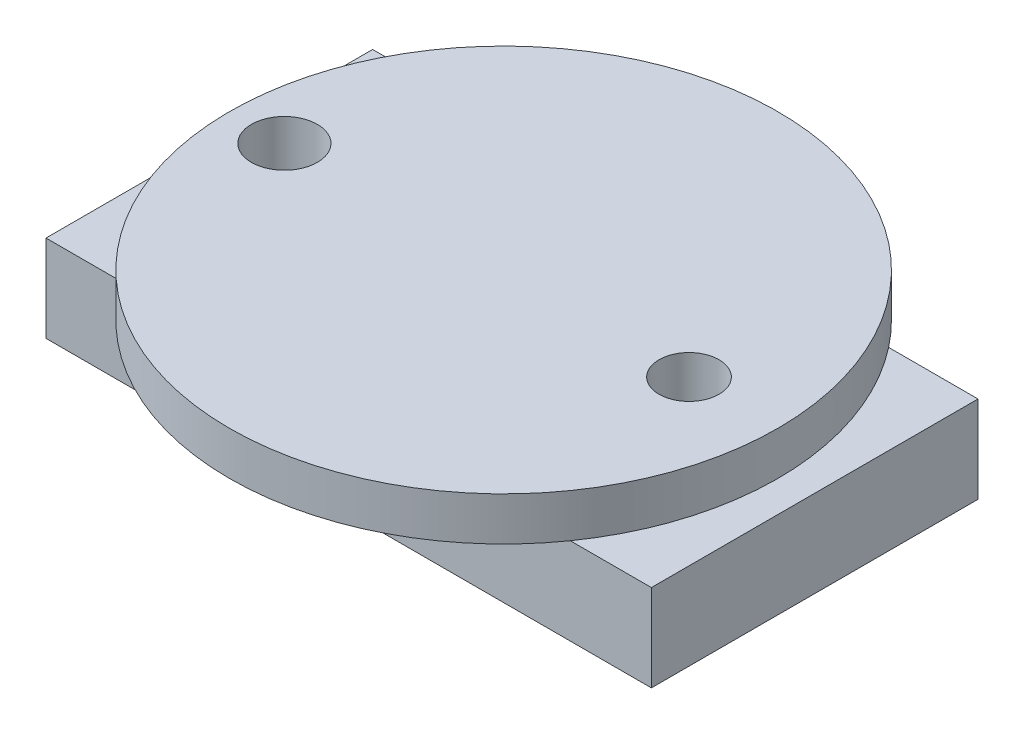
ISO-10303-21;
HEADER;
FILE_DESCRIPTION(('STEP AP214'),'2;1');
FILE_NAME('part.step','',(''),(''),'','','');
FILE_SCHEMA(('AUTOMOTIVE_DESIGN { 1 0 10303 214 1 1 1 1 }'));
ENDSEC;
DATA;
#1=APPLICATION_CONTEXT('core data for automotive mechanical design processes');
#2=APPLICATION_PROTOCOL_DEFINITION('international standard','automotive_design',2000,#1);
#3=PRODUCT_CONTEXT('',#1,'mechanical');
#4=PRODUCT('Part','Part','',(#3));
#5=PRODUCT_RELATED_PRODUCT_CATEGORY('part','',(#4));
#6=PRODUCT_DEFINITION_FORMATION('','',#4);
#7=PRODUCT_DEFINITION_CONTEXT('part definition',#1,'design');
#8=PRODUCT_DEFINITION('design','',#6,#7);
#9=PRODUCT_DEFINITION_SHAPE('','',#8);
#10=(LENGTH_UNIT() NAMED_UNIT(*) SI_UNIT(.MILLI.,.METRE.));
#11=(NAMED_UNIT(*) PLANE_ANGLE_UNIT() SI_UNIT($,.RADIAN.));
#12=(NAMED_UNIT(*) SI_UNIT($,.STERADIAN.) SOLID_ANGLE_UNIT());
#13=UNCERTAINTY_MEASURE_WITH_UNIT(LENGTH_MEASURE(1.E-05),#10,'distance_accuracy_value','');
#14=(GEOMETRIC_REPRESENTATION_CONTEXT(3) GLOBAL_UNCERTAINTY_ASSIGNED_CONTEXT((#13)) GLOBAL_UNIT_ASSIGNED_CONTEXT((#10,
#11,#12)) REPRESENTATION_CONTEXT('',''));
#15=CARTESIAN_POINT('',(0.,0.,0.));
#16=DIRECTION('',(0.,0.,1.));
#17=DIRECTION('',(1.,0.,0.));
#18=AXIS2_PLACEMENT_3D('',#15,#16,#17);
#19=CARTESIAN_POINT('',(-60.2555483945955,12.7,0.));
#20=DIRECTION('',(0.,1.,0.));
#21=DIRECTION('',(0.,0.,1.));
#22=AXIS2_PLACEMENT_3D('',#19,#20,#21);
#23=PLANE('',#22);
#24=CARTESIAN_POINT('',(-60.2555483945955,12.7,0.));
#25=DIRECTION('',(0.,1.,0.));
#26=DIRECTION('',(0.,0.,1.));
#27=AXIS2_PLACEMENT_3D('',#24,#25,#26);
#28=CIRCLE('',#27,80.1370931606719);
#29=CARTESIAN_POINT('',(2.87709007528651,12.7,-49.3581164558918));
#30=VERTEX_POINT('',#29);
#31=CARTESIAN_POINT('',(-123.388186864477,12.7,-49.3581164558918));
#32=VERTEX_POINT('',#31);
#33=EDGE_CURVE('E496',#30,#32,#28,.T.);
#34=ORIENTED_EDGE('',*,*,#33,.F.);
#35=DIRECTION('',(1.,0.,0.));
#36=VECTOR('',#35,1.);
#37=CARTESIAN_POINT('',(0.,12.7,-49.3581164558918));
#38=LINE('',#37,#36);
#39=EDGE_CURVE('E356',#32,#30,#38,.T.);
#40=ORIENTED_EDGE('',*,*,#39,.F.);
#41=EDGE_LOOP('',(#34,#40));
#42=FACE_BOUND('',#41,.T.);
#43=ADVANCED_FACE('F88',(#42),#23,.F.);
#44=DIRECTION('',(1.,0.,0.));
#45=VECTOR('',#44,1.);
#46=CARTESIAN_POINT('',(0.,12.7,46.0863602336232));
#47=LINE('',#46,#45);
#48=CARTESIAN_POINT('',(-125.814690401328,12.7,46.0863602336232));
#49=VERTEX_POINT('',#48);
#50=CARTESIAN_POINT('',(5.303593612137,12.7,46.0863602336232));
#51=VERTEX_POINT('',#50);
#52=EDGE_CURVE('E364',#49,#51,#47,.T.);
#53=ORIENTED_EDGE('',*,*,#52,.T.);
#54=EDGE_CURVE('E484',#49,#51,#28,.T.);
#55=ORIENTED_EDGE('',*,*,#54,.F.);
#56=EDGE_LOOP('',(#53,#55));
#57=FACE_BOUND('',#56,.T.);
#58=ADVANCED_FACE('F607',(#57),#23,.F.);
#59=CARTESIAN_POINT('',(-45.9128356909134,12.7,0.));
#60=DIRECTION('',(0.,-1.,0.));
#61=DIRECTION('',(0.,0.,-1.));
#62=AXIS2_PLACEMENT_3D('',#59,#60,#61);
#63=CYLINDRICAL_SURFACE('',#62,16.9408801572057);
#64=CARTESIAN_POINT('',(-45.9128356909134,0.,0.));
#65=DIRECTION('',(0.,1.,0.));
#66=DIRECTION('',(0.,0.,1.));
#67=AXIS2_PLACEMENT_3D('',#64,#65,#66);
#68=CIRCLE('',#67,16.9408801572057);
#69=CARTESIAN_POINT('',(-62.0762271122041,0.,-5.07328278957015));
#70=VERTEX_POINT('',#69);
#71=CARTESIAN_POINT('',(-62.0716324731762,0.,5.08789809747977));
#72=VERTEX_POINT('',#71);
#73=EDGE_CURVE('E491',#70,#72,#68,.T.);
#74=ORIENTED_EDGE('',*,*,#73,.F.);
#75=DIRECTION('',(0.,-1.,0.));
#76=VECTOR('',#75,1.);
#77=CARTESIAN_POINT('',(-62.0762271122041,12.7,-5.07328278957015));
#78=LINE('',#77,#76);
#79=CARTESIAN_POINT('',(-62.0762271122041,12.7,-5.07328278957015));
#80=VERTEX_POINT('',#79);
#81=EDGE_CURVE('E12',#80,#70,#78,.T.);
#82=ORIENTED_EDGE('',*,*,#81,.F.);
#83=CARTESIAN_POINT('',(-45.9128356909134,12.7,0.));
#84=DIRECTION('',(0.,1.,0.));
#85=DIRECTION('',(0.,0.,1.));
#86=AXIS2_PLACEMENT_3D('',#83,#84,#85);
#87=CIRCLE('',#86,16.9408801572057);
#88=CARTESIAN_POINT('',(-62.0716324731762,12.7,5.08789809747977));
#89=VERTEX_POINT('',#88);
#90=EDGE_CURVE('E497',#80,#89,#87,.T.);
#91=ORIENTED_EDGE('',*,*,#90,.T.);
#92=DIRECTION('',(0.,-1.,0.));
#93=VECTOR('',#92,1.);
#94=CARTESIAN_POINT('',(-62.0716324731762,12.7,5.08789809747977));
#95=LINE('',#94,#93);
#96=EDGE_CURVE('E525',#89,#72,#95,.T.);
#97=ORIENTED_EDGE('',*,*,#96,.T.);
#98=EDGE_LOOP('',(#74,#82,#91,#97));
#99=FACE_BOUND('',#98,.T.);
#100=ADVANCED_FACE('F90',(#99),#63,.F.);
#101=CARTESIAN_POINT('',(-44.4304299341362,12.7,25.5782106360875));
#102=DIRECTION('',(-0.866647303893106,0.,0.498921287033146));
#103=DIRECTION('',(0.498921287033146,0.,0.866647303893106));
#104=AXIS2_PLACEMENT_3D('',#101,#102,#103);
#105=PLANE('',#104);
#106=DIRECTION('',(-0.498921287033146,0.,-0.866647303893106));
#107=VECTOR('',#106,1.);
#108=CARTESIAN_POINT('',(-44.4304299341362,0.,25.5782106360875));
#109=LINE('',#108,#107);
#110=CARTESIAN_POINT('',(-69.517094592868,0.,-17.9983832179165));
#111=VERTEX_POINT('',#110);
#112=EDGE_CURVE('E528',#70,#111,#109,.T.);
#113=ORIENTED_EDGE('',*,*,#112,.T.);
#114=DIRECTION('',(0.,-1.,0.));
#115=VECTOR('',#114,1.);
#116=CARTESIAN_POINT('',(-69.517094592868,12.7,-17.9983832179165));
#117=LINE('',#116,#115);
#118=CARTESIAN_POINT('',(-69.517094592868,12.7,-17.9983832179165));
#119=VERTEX_POINT('',#118);
#120=EDGE_CURVE('E97',#119,#111,#117,.T.);
#121=ORIENTED_EDGE('',*,*,#120,.F.);
#122=DIRECTION('',(-0.498921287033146,0.,-0.866647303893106));
#123=VECTOR('',#122,1.);
#124=CARTESIAN_POINT('',(-44.4304299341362,12.7,25.5782106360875));
#125=LINE('',#124,#123);
#126=EDGE_CURVE('E500',#80,#119,#125,.T.);
#127=ORIENTED_EDGE('',*,*,#126,.F.);
#128=ORIENTED_EDGE('',*,*,#81,.T.);
#129=EDGE_LOOP('',(#113,#121,#127,#128));
#130=FACE_BOUND('',#129,.T.);
#131=ADVANCED_FACE('F576',(#130),#105,.F.);
#132=CARTESIAN_POINT('',(0.0223027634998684,12.7,-17.9117966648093));
#133=DIRECTION('',(-0.0012451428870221,0.,0.999999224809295));
#134=DIRECTION('',(0.999999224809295,0.,0.0012451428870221));
#135=AXIS2_PLACEMENT_3D('',#132,#133,#134);
#136=PLANE('',#135);
#137=DIRECTION('',(-0.999999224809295,0.,-0.0012451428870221));
#138=VECTOR('',#137,1.);
#139=CARTESIAN_POINT('',(0.0223027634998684,0.,-17.9117966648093));
#140=LINE('',#139,#138);
#141=CARTESIAN_POINT('',(-90.3147885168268,0.,-18.0242793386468));
#142=VERTEX_POINT('',#141);
#143=EDGE_CURVE('E532',#111,#142,#140,.T.);
#144=ORIENTED_EDGE('',*,*,#143,.T.);
#145=DIRECTION('',(0.,-1.,0.));
#146=VECTOR('',#145,1.);
#147=CARTESIAN_POINT('',(-90.3147885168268,12.7,-18.0242793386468));
#148=LINE('',#147,#146);
#149=CARTESIAN_POINT('',(-90.3147885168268,12.7,-18.0242793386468));
#150=VERTEX_POINT('',#149);
#151=EDGE_CURVE('E566',#150,#142,#148,.T.);
#152=ORIENTED_EDGE('',*,*,#151,.F.);
#153=DIRECTION('',(-0.999999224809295,0.,-0.0012451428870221));
#154=VECTOR('',#153,1.);
#155=CARTESIAN_POINT('',(0.0223027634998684,12.7,-17.9117966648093));
#156=LINE('',#155,#154);
#157=EDGE_CURVE('E505',#119,#150,#156,.T.);
#158=ORIENTED_EDGE('',*,*,#157,.F.);
#159=ORIENTED_EDGE('',*,*,#120,.T.);
#160=EDGE_LOOP('',(#144,#152,#158,#159));
#161=FACE_BOUND('',#160,.T.);
#162=ADVANCED_FACE('F573',(#161),#136,.F.);
#163=CARTESIAN_POINT('',(-75.4545718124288,12.7,-43.6890765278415));
#164=DIRECTION('',(0.865402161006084,0.,0.50107793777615));
#165=DIRECTION('',(0.50107793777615,0.,-0.865402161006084));
#166=AXIS2_PLACEMENT_3D('',#163,#164,#165);
#167=PLANE('',#166);
#168=DIRECTION('',(-0.50107793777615,0.,0.865402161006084));
#169=VECTOR('',#168,1.);
#170=CARTESIAN_POINT('',(-75.4545718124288,0.,-43.6890765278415));
#171=LINE('',#170,#169);
#172=CARTESIAN_POINT('',(-100.736062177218,0.,-0.0258961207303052));
#173=VERTEX_POINT('',#172);
#174=EDGE_CURVE('E536',#142,#173,#171,.T.);
#175=ORIENTED_EDGE('',*,*,#174,.T.);
#176=DIRECTION('',(0.,-1.,0.));
#177=VECTOR('',#176,1.);
#178=CARTESIAN_POINT('',(-100.736062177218,12.7,-0.0258961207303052));
#179=LINE('',#178,#177);
#180=CARTESIAN_POINT('',(-100.736062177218,12.7,-0.0258961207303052));
#181=VERTEX_POINT('',#180);
#182=EDGE_CURVE('E562',#181,#173,#179,.T.);
#183=ORIENTED_EDGE('',*,*,#182,.F.);
#184=DIRECTION('',(-0.50107793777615,0.,0.865402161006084));
#185=VECTOR('',#184,1.);
#186=CARTESIAN_POINT('',(-75.4545718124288,12.7,-43.6890765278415));
#187=LINE('',#186,#185);
#188=EDGE_CURVE('E509',#150,#181,#187,.T.);
#189=ORIENTED_EDGE('',*,*,#188,.F.);
#190=ORIENTED_EDGE('',*,*,#151,.T.);
#191=EDGE_LOOP('',(#175,#183,#189,#190));
#192=FACE_BOUND('',#191,.T.);
#193=ADVANCED_FACE('F582',(#192),#167,.F.);
#194=CARTESIAN_POINT('',(-75.6493975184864,12.7,43.5506977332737));
#195=DIRECTION('',(0.866647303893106,0.,-0.498921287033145));
#196=DIRECTION('',(-0.498921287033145,0.,-0.866647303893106));
#197=AXIS2_PLACEMENT_3D('',#194,#195,#196);
#198=PLANE('',#197);
#199=DIRECTION('',(0.498921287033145,0.,0.866647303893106));
#200=VECTOR('',#199,1.);
#201=CARTESIAN_POINT('',(-75.6493975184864,0.,43.5506977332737));
#202=LINE('',#201,#200);
#203=CARTESIAN_POINT('',(-90.3596419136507,0.,17.9983832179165));
#204=VERTEX_POINT('',#203);
#205=EDGE_CURVE('E540',#173,#204,#202,.T.);
#206=ORIENTED_EDGE('',*,*,#205,.T.);
#207=DIRECTION('',(0.,-1.,0.));
#208=VECTOR('',#207,1.);
#209=CARTESIAN_POINT('',(-90.3596419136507,12.7,17.9983832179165));
#210=LINE('',#209,#208);
#211=CARTESIAN_POINT('',(-90.3596419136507,12.7,17.9983832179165));
#212=VERTEX_POINT('',#211);
#213=EDGE_CURVE('E558',#212,#204,#210,.T.);
#214=ORIENTED_EDGE('',*,*,#213,.F.);
#215=DIRECTION('',(0.498921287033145,0.,0.866647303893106));
#216=VECTOR('',#215,1.);
#217=CARTESIAN_POINT('',(-75.6493975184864,12.7,43.5506977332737));
#218=LINE('',#217,#216);
#219=EDGE_CURVE('E513',#181,#212,#218,.T.);
#220=ORIENTED_EDGE('',*,*,#219,.F.);
#221=ORIENTED_EDGE('',*,*,#182,.T.);
#222=EDGE_LOOP('',(#206,#214,#220,#221));
#223=FACE_BOUND('',#222,.T.);
#224=ADVANCED_FACE('F586',(#223),#198,.F.);
#225=CARTESIAN_POINT('',(-0.0225506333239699,12.7,18.110865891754));
#226=DIRECTION('',(0.0012451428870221,0.,-0.999999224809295));
#227=DIRECTION('',(-0.999999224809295,0.,-0.0012451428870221));
#228=AXIS2_PLACEMENT_3D('',#225,#226,#227);
#229=PLANE('',#228);
#230=DIRECTION('',(0.999999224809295,0.,0.0012451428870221));
#231=VECTOR('',#230,1.);
#232=CARTESIAN_POINT('',(-0.0225506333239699,0.,18.110865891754));
#233=LINE('',#232,#231);
#234=CARTESIAN_POINT('',(-69.5619479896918,0.,18.0242793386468));
#235=VERTEX_POINT('',#234);
#236=EDGE_CURVE('E544',#204,#235,#233,.T.);
#237=ORIENTED_EDGE('',*,*,#236,.T.);
#238=DIRECTION('',(0.,-1.,0.));
#239=VECTOR('',#238,1.);
#240=CARTESIAN_POINT('',(-69.5619479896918,12.7,18.0242793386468));
#241=LINE('',#240,#239);
#242=CARTESIAN_POINT('',(-69.5619479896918,12.7,18.0242793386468));
#243=VERTEX_POINT('',#242);
#244=EDGE_CURVE('E554',#243,#235,#241,.T.);
#245=ORIENTED_EDGE('',*,*,#244,.F.);
#246=DIRECTION('',(0.999999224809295,0.,0.0012451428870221));
#247=VECTOR('',#246,1.);
#248=CARTESIAN_POINT('',(-0.0225506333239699,12.7,18.110865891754));
#249=LINE('',#248,#247);
#250=EDGE_CURVE('E517',#212,#243,#249,.T.);
#251=ORIENTED_EDGE('',*,*,#250,.F.);
#252=ORIENTED_EDGE('',*,*,#213,.T.);
#253=EDGE_LOOP('',(#237,#245,#251,#252));
#254=FACE_BOUND('',#253,.T.);
#255=ADVANCED_FACE('F596',(#254),#229,.F.);
#256=CARTESIAN_POINT('',(-44.2804576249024,12.7,-25.6389010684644));
#257=DIRECTION('',(-0.865402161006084,0.,-0.50107793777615));
#258=DIRECTION('',(-0.50107793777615,0.,0.865402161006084));
#259=AXIS2_PLACEMENT_3D('',#256,#257,#258);
#260=PLANE('',#259);
#261=DIRECTION('',(0.501077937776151,0.,-0.865402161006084));
#262=VECTOR('',#261,1.);
#263=CARTESIAN_POINT('',(-44.2804576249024,0.,-25.6389010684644));
#264=LINE('',#263,#262);
#265=EDGE_CURVE('E501',#235,#72,#264,.T.);
#266=ORIENTED_EDGE('',*,*,#265,.T.);
#267=ORIENTED_EDGE('',*,*,#96,.F.);
#268=DIRECTION('',(0.501077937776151,0.,-0.865402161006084));
#269=VECTOR('',#268,1.);
#270=CARTESIAN_POINT('',(-44.2804576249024,12.7,-25.6389010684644));
#271=LINE('',#270,#269);
#272=EDGE_CURVE('E521',#243,#89,#271,.T.);
#273=ORIENTED_EDGE('',*,*,#272,.F.);
#274=ORIENTED_EDGE('',*,*,#244,.T.);
#275=EDGE_LOOP('',(#266,#267,#273,#274));
#276=FACE_BOUND('',#275,.T.);
#277=ADVANCED_FACE('F594',(#276),#260,.F.);
#278=CARTESIAN_POINT('',(-60.2555483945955,25.4,0.));
#279=DIRECTION('',(0.,1.,0.));
#280=DIRECTION('',(0.,0.,1.));
#281=AXIS2_PLACEMENT_3D('',#278,#279,#280);
#282=PLANE('',#281);
#283=CARTESIAN_POINT('',(-124.336179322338,25.4,0.));
#284=DIRECTION('',(0.,1.,0.));
#285=DIRECTION('',(0.,0.,1.));
#286=AXIS2_PLACEMENT_3D('',#283,#284,#285);
#287=CIRCLE('',#286,9.63258004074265);
#288=CARTESIAN_POINT('',(-124.336179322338,25.4,9.63258004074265));
#289=VERTEX_POINT('',#288);
#290=EDGE_CURVE('E480',#289,#289,#287,.T.);
#291=ORIENTED_EDGE('',*,*,#290,.F.);
#292=EDGE_LOOP('',(#291));
#293=FACE_BOUND('',#292,.T.);
#294=CARTESIAN_POINT('',(-60.2555483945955,25.4,0.));
#295=DIRECTION('',(0.,1.,0.));
#296=DIRECTION('',(0.,0.,1.));
#297=AXIS2_PLACEMENT_3D('',#294,#295,#296);
#298=CIRCLE('',#297,80.1370931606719);
#299=CARTESIAN_POINT('',(-60.2555483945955,25.4,80.1370931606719));
#300=VERTEX_POINT('',#299);
#301=EDGE_CURVE('E487',#300,#300,#298,.T.);
#302=ORIENTED_EDGE('',*,*,#301,.T.);
#303=EDGE_LOOP('',(#302));
#304=FACE_BOUND('',#303,.T.);
#305=CARTESIAN_POINT('',(-6.09124595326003,25.4,0.));
#306=DIRECTION('',(0.,1.,0.));
#307=DIRECTION('',(0.,0.,1.));
#308=AXIS2_PLACEMENT_3D('',#305,#306,#307);
#309=CIRCLE('',#308,8.7605529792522);
#310=CARTESIAN_POINT('',(-6.09124595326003,25.4,8.7605529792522));
#311=VERTEX_POINT('',#310);
#312=EDGE_CURVE('E473',#311,#311,#309,.T.);
#313=ORIENTED_EDGE('',*,*,#312,.F.);
#314=EDGE_LOOP('',(#313));
#315=FACE_BOUND('',#314,.T.);
#316=ADVANCED_FACE('F603',(#293,#304,#315),#282,.T.);
#317=ORIENTED_EDGE('',*,*,#90,.F.);
#318=ORIENTED_EDGE('',*,*,#126,.T.);
#319=ORIENTED_EDGE('',*,*,#157,.T.);
#320=ORIENTED_EDGE('',*,*,#188,.T.);
#321=ORIENTED_EDGE('',*,*,#219,.T.);
#322=ORIENTED_EDGE('',*,*,#250,.T.);
#323=ORIENTED_EDGE('',*,*,#272,.T.);
#324=EDGE_LOOP('',(#317,#318,#319,#320,#321,#322,#323));
#325=FACE_BOUND('',#324,.T.);
#326=CARTESIAN_POINT('',(-6.09124595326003,12.7,0.));
#327=DIRECTION('',(0.,1.,0.));
#328=DIRECTION('',(0.,0.,1.));
#329=AXIS2_PLACEMENT_3D('',#326,#327,#328);
#330=CIRCLE('',#329,8.7605529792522);
#331=CARTESIAN_POINT('',(-14.4770267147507,12.7,-2.53494960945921));
#332=VERTEX_POINT('',#331);
#333=CARTESIAN_POINT('',(-14.4770267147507,12.7,2.53494960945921));
#334=VERTEX_POINT('',#333);
#335=EDGE_CURVE('E472',#332,#334,#330,.T.);
#336=ORIENTED_EDGE('',*,*,#335,.T.);
#337=DIRECTION('',(1.,0.,0.));
#338=VECTOR('',#337,1.);
#339=CARTESIAN_POINT('',(0.,12.7,2.53494960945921));
#340=LINE('',#339,#338);
#341=CARTESIAN_POINT('',(-29.1626879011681,12.7,2.53494960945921));
#342=VERTEX_POINT('',#341);
#343=EDGE_CURVE('E104',#342,#334,#340,.T.);
#344=ORIENTED_EDGE('',*,*,#343,.F.);
#345=CARTESIAN_POINT('',(-45.9128356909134,12.7,0.));
#346=DIRECTION('',(0.,1.,0.));
#347=DIRECTION('',(0.,0.,1.));
#348=AXIS2_PLACEMENT_3D('',#345,#346,#347);
#349=CIRCLE('',#348,16.9408801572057);
#350=CARTESIAN_POINT('',(-60.6979548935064,12.7,8.27004659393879));
#351=VERTEX_POINT('',#350);
#352=EDGE_CURVE('E109',#351,#342,#349,.T.);
#353=ORIENTED_EDGE('',*,*,#352,.F.);
#354=DIRECTION('',(0.499999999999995,0.,-0.866025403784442));
#355=VECTOR('',#354,1.);
#356=CARTESIAN_POINT('',(-41.9424309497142,12.7,-24.2154737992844));
#357=LINE('',#356,#355);
#358=CARTESIAN_POINT('',(-67.930804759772,12.7,20.7977100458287));
#359=VERTEX_POINT('',#358);
#360=EDGE_CURVE('E309',#359,#351,#357,.T.);
#361=ORIENTED_EDGE('',*,*,#360,.F.);
#362=DIRECTION('',(1.,0.,0.));
#363=VECTOR('',#362,1.);
#364=CARTESIAN_POINT('',(2.16333302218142E-13,12.7,20.797710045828));
#365=LINE('',#364,#363);
#366=CARTESIAN_POINT('',(-91.9459317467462,12.7,20.797710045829));
#367=VERTEX_POINT('',#366);
#368=EDGE_CURVE('E313',#367,#359,#365,.T.);
#369=ORIENTED_EDGE('',*,*,#368,.F.);
#370=DIRECTION('',(0.500000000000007,0.,0.866025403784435));
#371=VECTOR('',#370,1.);
#372=CARTESIAN_POINT('',(-77.9651214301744,12.7,45.0131838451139));
#373=LINE('',#372,#371);
#374=CARTESIAN_POINT('',(-102.48994140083,12.7,2.53494960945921));
#375=VERTEX_POINT('',#374);
#376=EDGE_CURVE('E317',#375,#367,#373,.T.);
#377=ORIENTED_EDGE('',*,*,#376,.F.);
#378=DIRECTION('',(1.,0.,0.));
#379=VECTOR('',#378,1.);
#380=CARTESIAN_POINT('',(0.,12.7,2.53494960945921));
#381=LINE('',#380,#379);
#382=CARTESIAN_POINT('',(-115.043137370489,12.7,2.5349496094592));
#383=VERTEX_POINT('',#382);
#384=EDGE_CURVE('E321',#383,#375,#381,.T.);
#385=ORIENTED_EDGE('',*,*,#384,.F.);
#386=CARTESIAN_POINT('',(-124.336179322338,12.7,0.));
#387=DIRECTION('',(0.,1.,0.));
#388=DIRECTION('',(0.,0.,1.));
#389=AXIS2_PLACEMENT_3D('',#386,#387,#388);
#390=CIRCLE('',#389,9.63258004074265);
#391=CARTESIAN_POINT('',(-115.043137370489,12.7,-2.5349496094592));
#392=VERTEX_POINT('',#391);
#393=EDGE_CURVE('E477',#383,#392,#390,.T.);
#394=ORIENTED_EDGE('',*,*,#393,.T.);
#395=DIRECTION('',(1.,0.,0.));
#396=VECTOR('',#395,1.);
#397=CARTESIAN_POINT('',(0.,12.7,-2.53494960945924));
#398=LINE('',#397,#396);
#399=CARTESIAN_POINT('',(-102.48994140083,12.7,-2.53494960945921));
#400=VERTEX_POINT('',#399);
#401=EDGE_CURVE('E325',#392,#400,#398,.T.);
#402=ORIENTED_EDGE('',*,*,#401,.T.);
#403=DIRECTION('',(-0.499999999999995,0.,0.866025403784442));
#404=VECTOR('',#403,1.);
#405=CARTESIAN_POINT('',(-77.9651214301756,12.7,-45.0131838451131));
#406=LINE('',#405,#404);
#407=CARTESIAN_POINT('',(-91.9459317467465,12.7,-20.7977100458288));
#408=VERTEX_POINT('',#407);
#409=EDGE_CURVE('E328',#408,#400,#406,.T.);
#410=ORIENTED_EDGE('',*,*,#409,.F.);
#411=DIRECTION('',(-1.,0.,0.));
#412=VECTOR('',#411,1.);
#413=CARTESIAN_POINT('',(0.,12.7,-20.7977100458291));
#414=LINE('',#413,#412);
#415=CARTESIAN_POINT('',(-67.9308047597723,12.7,-20.7977100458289));
#416=VERTEX_POINT('',#415);
#417=EDGE_CURVE('E332',#416,#408,#414,.T.);
#418=ORIENTED_EDGE('',*,*,#417,.F.);
#419=DIRECTION('',(-0.500000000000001,0.,-0.866025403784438));
#420=VECTOR('',#419,1.);
#421=CARTESIAN_POINT('',(-41.9424309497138,12.7,24.2154737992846));
#422=LINE('',#421,#420);
#423=CARTESIAN_POINT('',(-60.6979548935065,12.7,-8.27004659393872));
#424=VERTEX_POINT('',#423);
#425=EDGE_CURVE('E336',#424,#416,#422,.T.);
#426=ORIENTED_EDGE('',*,*,#425,.F.);
#427=CARTESIAN_POINT('',(-45.9128356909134,12.7,0.));
#428=DIRECTION('',(0.,1.,0.));
#429=DIRECTION('',(0.,0.,1.));
#430=AXIS2_PLACEMENT_3D('',#427,#428,#429);
#431=CIRCLE('',#430,16.9408801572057);
#432=CARTESIAN_POINT('',(-29.1626879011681,12.7,-2.53494960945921));
#433=VERTEX_POINT('',#432);
#434=EDGE_CURVE('E340',#433,#424,#431,.T.);
#435=ORIENTED_EDGE('',*,*,#434,.F.);
#436=DIRECTION('',(1.,0.,0.));
#437=VECTOR('',#436,1.);
#438=CARTESIAN_POINT('',(0.,12.7,-2.53494960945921));
#439=LINE('',#438,#437);
#440=EDGE_CURVE('E344',#433,#332,#439,.T.);
#441=ORIENTED_EDGE('',*,*,#440,.T.);
#442=EDGE_LOOP('',(#336,#344,#353,#361,#369,#377,#385,#394,#402,#410,#418,#426,#435,#441));
#443=FACE_BOUND('',#442,.T.);
#444=ADVANCED_FACE('F589',(#325,#443),#23,.F.);
#445=CARTESIAN_POINT('',(-60.2555483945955,25.4,0.));
#446=DIRECTION('',(0.,-1.,0.));
#447=DIRECTION('',(0.,0.,-1.));
#448=AXIS2_PLACEMENT_3D('',#445,#446,#447);
#449=CYLINDRICAL_SURFACE('',#448,80.1370931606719);
#450=ORIENTED_EDGE('',*,*,#301,.F.);
#451=EDGE_LOOP('',(#450));
#452=FACE_BOUND('',#451,.T.);
#453=EDGE_CURVE('E492',#51,#30,#28,.T.);
#454=ORIENTED_EDGE('',*,*,#453,.T.);
#455=ORIENTED_EDGE('',*,*,#33,.T.);
#456=CARTESIAN_POINT('',(-60.2555483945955,12.7,0.));
#457=DIRECTION('',(0.,1.,0.));
#458=DIRECTION('',(0.,0.,1.));
#459=AXIS2_PLACEMENT_3D('',#456,#457,#458);
#460=CIRCLE('',#459,80.1370931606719);
#461=EDGE_CURVE('E427',#32,#49,#460,.T.);
#462=ORIENTED_EDGE('',*,*,#461,.T.);
#463=ORIENTED_EDGE('',*,*,#54,.T.);
#464=EDGE_LOOP('',(#454,#455,#462,#463));
#465=FACE_BOUND('',#464,.T.);
#466=ADVANCED_FACE('F618',(#452,#465),#449,.T.);
#467=CARTESIAN_POINT('',(-124.336179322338,25.4,0.));
#468=DIRECTION('',(0.,-1.,0.));
#469=DIRECTION('',(0.,0.,-1.));
#470=AXIS2_PLACEMENT_3D('',#467,#468,#469);
#471=CYLINDRICAL_SURFACE('',#470,9.63258004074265);
#472=ORIENTED_EDGE('',*,*,#290,.T.);
#473=EDGE_LOOP('',(#472));
#474=FACE_BOUND('',#473,.T.);
#475=ORIENTED_EDGE('',*,*,#393,.F.);
#476=DIRECTION('',(0.,-1.,0.));
#477=VECTOR('',#476,1.);
#478=CARTESIAN_POINT('',(-115.043137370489,12.7,2.53494960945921));
#479=LINE('',#478,#477);
#480=CARTESIAN_POINT('',(-115.043137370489,0.,2.53494960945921));
#481=VERTEX_POINT('',#480);
#482=EDGE_CURVE('E448',#383,#481,#479,.T.);
#483=ORIENTED_EDGE('',*,*,#482,.T.);
#484=CARTESIAN_POINT('',(-124.336179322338,0.,0.));
#485=DIRECTION('',(0.,1.,0.));
#486=DIRECTION('',(0.,0.,1.));
#487=AXIS2_PLACEMENT_3D('',#484,#485,#486);
#488=CIRCLE('',#487,9.63258004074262);
#489=CARTESIAN_POINT('',(-115.043137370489,0.,-2.53494960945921));
#490=VERTEX_POINT('',#489);
#491=EDGE_CURVE('E392',#490,#481,#488,.T.);
#492=ORIENTED_EDGE('',*,*,#491,.F.);
#493=DIRECTION('',(0.,-1.,0.));
#494=VECTOR('',#493,1.);
#495=CARTESIAN_POINT('',(-115.043137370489,12.7,-2.53494960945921));
#496=LINE('',#495,#494);
#497=EDGE_CURVE('E445',#392,#490,#496,.T.);
#498=ORIENTED_EDGE('',*,*,#497,.F.);
#499=EDGE_LOOP('',(#475,#483,#492,#498));
#500=FACE_BOUND('',#499,.T.);
#501=ADVANCED_FACE('F623',(#474,#500),#471,.F.);
#502=CARTESIAN_POINT('',(-6.09124595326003,25.4,0.));
#503=DIRECTION('',(0.,-1.,0.));
#504=DIRECTION('',(0.,0.,-1.));
#505=AXIS2_PLACEMENT_3D('',#502,#503,#504);
#506=CYLINDRICAL_SURFACE('',#505,8.7605529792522);
#507=ORIENTED_EDGE('',*,*,#312,.T.);
#508=EDGE_LOOP('',(#507));
#509=FACE_BOUND('',#508,.T.);
#510=ORIENTED_EDGE('',*,*,#335,.F.);
#511=DIRECTION('',(0.,-1.,0.));
#512=VECTOR('',#511,1.);
#513=CARTESIAN_POINT('',(-14.4770267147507,12.7,-2.53494960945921));
#514=LINE('',#513,#512);
#515=CARTESIAN_POINT('',(-14.4770267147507,0.,-2.53494960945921));
#516=VERTEX_POINT('',#515);
#517=EDGE_CURVE('E363',#332,#516,#514,.T.);
#518=ORIENTED_EDGE('',*,*,#517,.T.);
#519=CARTESIAN_POINT('',(-6.09124595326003,0.,0.));
#520=DIRECTION('',(0.,1.,0.));
#521=DIRECTION('',(0.,0.,1.));
#522=AXIS2_PLACEMENT_3D('',#519,#520,#521);
#523=CIRCLE('',#522,8.7605529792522);
#524=CARTESIAN_POINT('',(-14.4770267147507,0.,2.53494960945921));
#525=VERTEX_POINT('',#524);
#526=EDGE_CURVE('E303',#525,#516,#523,.T.);
#527=ORIENTED_EDGE('',*,*,#526,.F.);
#528=DIRECTION('',(0.,-1.,0.));
#529=VECTOR('',#528,1.);
#530=CARTESIAN_POINT('',(-14.4770267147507,12.7,2.53494960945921));
#531=LINE('',#530,#529);
#532=EDGE_CURVE('E422',#334,#525,#531,.T.);
#533=ORIENTED_EDGE('',*,*,#532,.F.);
#534=EDGE_LOOP('',(#510,#518,#527,#533));
#535=FACE_BOUND('',#534,.T.);
#536=ADVANCED_FACE('F633',(#509,#535),#506,.F.);
#537=CARTESIAN_POINT('',(0.,12.7,0.));
#538=DIRECTION('',(0.,1.,0.));
#539=DIRECTION('',(0.,0.,1.));
#540=AXIS2_PLACEMENT_3D('',#537,#538,#539);
#541=PLANE('',#540);
#542=ORIENTED_EDGE('',*,*,#453,.F.);
#543=CARTESIAN_POINT('',(28.9923876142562,12.7,46.0863602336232));
#544=VERTEX_POINT('',#543);
#545=EDGE_CURVE('E359',#51,#544,#47,.T.);
#546=ORIENTED_EDGE('',*,*,#545,.T.);
#547=DIRECTION('',(0.,0.,1.));
#548=VECTOR('',#547,1.);
#549=CARTESIAN_POINT('',(28.9923876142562,12.7,0.));
#550=LINE('',#549,#548);
#551=CARTESIAN_POINT('',(28.9923876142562,12.7,-49.3581164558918));
#552=VERTEX_POINT('',#551);
#553=EDGE_CURVE('E348',#552,#544,#550,.T.);
#554=ORIENTED_EDGE('',*,*,#553,.F.);
#555=EDGE_CURVE('E352',#30,#552,#38,.T.);
#556=ORIENTED_EDGE('',*,*,#555,.F.);
#557=EDGE_LOOP('',(#542,#546,#554,#556));
#558=FACE_BOUND('',#557,.T.);
#559=ADVANCED_FACE('F637',(#558),#541,.T.);
#560=ORIENTED_EDGE('',*,*,#461,.F.);
#561=CARTESIAN_POINT('',(-147.906697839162,12.7,-49.3581164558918));
#562=VERTEX_POINT('',#561);
#563=EDGE_CURVE('E353',#562,#32,#38,.T.);
#564=ORIENTED_EDGE('',*,*,#563,.F.);
#565=DIRECTION('',(0.,0.,1.));
#566=VECTOR('',#565,1.);
#567=CARTESIAN_POINT('',(-147.906697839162,12.7,0.));
#568=LINE('',#567,#566);
#569=CARTESIAN_POINT('',(-147.906697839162,12.7,46.0863602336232));
#570=VERTEX_POINT('',#569);
#571=EDGE_CURVE('E274',#562,#570,#568,.T.);
#572=ORIENTED_EDGE('',*,*,#571,.T.);
#573=EDGE_CURVE('E360',#570,#49,#47,.T.);
#574=ORIENTED_EDGE('',*,*,#573,.T.);
#575=EDGE_LOOP('',(#560,#564,#572,#574));
#576=FACE_BOUND('',#575,.T.);
#577=ADVANCED_FACE('F691',(#576),#541,.T.);
#578=CARTESIAN_POINT('',(28.9923876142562,12.7,0.));
#579=DIRECTION('',(1.,0.,0.));
#580=DIRECTION('',(0.,0.,-1.));
#581=AXIS2_PLACEMENT_3D('',#578,#579,#580);
#582=PLANE('',#581);
#583=DIRECTION('',(0.,-1.,0.));
#584=VECTOR('',#583,1.);
#585=CARTESIAN_POINT('',(28.9923876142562,12.7,46.0863602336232));
#586=LINE('',#585,#584);
#587=CARTESIAN_POINT('',(28.9923876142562,-12.7,46.0863602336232));
#588=VERTEX_POINT('',#587);
#589=EDGE_CURVE('E419',#544,#588,#586,.T.);
#590=ORIENTED_EDGE('',*,*,#589,.T.);
#591=DIRECTION('',(0.,0.,1.));
#592=VECTOR('',#591,1.);
#593=CARTESIAN_POINT('',(28.9923876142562,-12.7,46.0863602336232));
#594=LINE('',#593,#592);
#595=CARTESIAN_POINT('',(28.9923876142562,-12.7,-49.3581164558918));
#596=VERTEX_POINT('',#595);
#597=EDGE_CURVE('E290',#596,#588,#594,.T.);
#598=ORIENTED_EDGE('',*,*,#597,.F.);
#599=DIRECTION('',(0.,-1.,0.));
#600=VECTOR('',#599,1.);
#601=CARTESIAN_POINT('',(28.9923876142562,12.7,-49.3581164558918));
#602=LINE('',#601,#600);
#603=EDGE_CURVE('E279',#552,#596,#602,.T.);
#604=ORIENTED_EDGE('',*,*,#603,.F.);
#605=ORIENTED_EDGE('',*,*,#553,.T.);
#606=EDGE_LOOP('',(#590,#598,#604,#605));
#607=FACE_BOUND('',#606,.T.);
#608=ADVANCED_FACE('F688',(#607),#582,.T.);
#609=CARTESIAN_POINT('',(0.,12.7,-49.3581164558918));
#610=DIRECTION('',(0.,0.,-1.));
#611=DIRECTION('',(-1.,0.,0.));
#612=AXIS2_PLACEMENT_3D('',#609,#610,#611);
#613=PLANE('',#612);
#614=ORIENTED_EDGE('',*,*,#603,.T.);
#615=DIRECTION('',(1.,0.,0.));
#616=VECTOR('',#615,1.);
#617=CARTESIAN_POINT('',(-147.906697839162,-12.7,-49.3581164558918));
#618=LINE('',#617,#616);
#619=CARTESIAN_POINT('',(-147.906697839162,-12.7,-49.3581164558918));
#620=VERTEX_POINT('',#619);
#621=EDGE_CURVE('E283',#620,#596,#618,.T.);
#622=ORIENTED_EDGE('',*,*,#621,.F.);
#623=DIRECTION('',(0.,-1.,0.));
#624=VECTOR('',#623,1.);
#625=CARTESIAN_POINT('',(-147.906697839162,12.7,-49.3581164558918));
#626=LINE('',#625,#624);
#627=EDGE_CURVE('E267',#562,#620,#626,.T.);
#628=ORIENTED_EDGE('',*,*,#627,.F.);
#629=ORIENTED_EDGE('',*,*,#563,.T.);
#630=ORIENTED_EDGE('',*,*,#39,.T.);
#631=ORIENTED_EDGE('',*,*,#555,.T.);
#632=EDGE_LOOP('',(#614,#622,#628,#629,#630,#631));
#633=FACE_BOUND('',#632,.T.);
#634=ADVANCED_FACE('F284',(#633),#613,.T.);
#635=CARTESIAN_POINT('',(-147.906697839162,12.7,0.));
#636=DIRECTION('',(1.,0.,0.));
#637=DIRECTION('',(0.,0.,-1.));
#638=AXIS2_PLACEMENT_3D('',#635,#636,#637);
#639=PLANE('',#638);
#640=ORIENTED_EDGE('',*,*,#627,.T.);
#641=DIRECTION('',(0.,0.,-1.));
#642=VECTOR('',#641,1.);
#643=CARTESIAN_POINT('',(-147.906697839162,-12.7,46.0863602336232));
#644=LINE('',#643,#642);
#645=CARTESIAN_POINT('',(-147.906697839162,-12.7,46.0863602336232));
#646=VERTEX_POINT('',#645);
#647=EDGE_CURVE('E272',#646,#620,#644,.T.);
#648=ORIENTED_EDGE('',*,*,#647,.F.);
#649=DIRECTION('',(0.,-1.,0.));
#650=VECTOR('',#649,1.);
#651=CARTESIAN_POINT('',(-147.906697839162,12.7,46.0863602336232));
#652=LINE('',#651,#650);
#653=EDGE_CURVE('E280',#570,#646,#652,.T.);
#654=ORIENTED_EDGE('',*,*,#653,.F.);
#655=ORIENTED_EDGE('',*,*,#571,.F.);
#656=EDGE_LOOP('',(#640,#648,#654,#655));
#657=FACE_BOUND('',#656,.T.);
#658=ADVANCED_FACE('F269',(#657),#639,.F.);
#659=CARTESIAN_POINT('',(0.,12.7,2.53494960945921));
#660=DIRECTION('',(0.,0.,-1.));
#661=DIRECTION('',(-1.,0.,0.));
#662=AXIS2_PLACEMENT_3D('',#659,#660,#661);
#663=PLANE('',#662);
#664=DIRECTION('',(1.,0.,0.));
#665=VECTOR('',#664,1.);
#666=CARTESIAN_POINT('',(0.,0.,2.53494960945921));
#667=LINE('',#666,#665);
#668=CARTESIAN_POINT('',(-29.1626879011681,0.,2.53494960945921));
#669=VERTEX_POINT('',#668);
#670=EDGE_CURVE('E368',#669,#525,#667,.T.);
#671=ORIENTED_EDGE('',*,*,#670,.F.);
#672=DIRECTION('',(0.,-1.,0.));
#673=VECTOR('',#672,1.);
#674=CARTESIAN_POINT('',(-29.1626879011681,12.7,2.53494960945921));
#675=LINE('',#674,#673);
#676=EDGE_CURVE('E463',#342,#669,#675,.T.);
#677=ORIENTED_EDGE('',*,*,#676,.F.);
#678=ORIENTED_EDGE('',*,*,#343,.T.);
#679=ORIENTED_EDGE('',*,*,#532,.T.);
#680=EDGE_LOOP('',(#671,#677,#678,#679));
#681=FACE_BOUND('',#680,.T.);
#682=ADVANCED_FACE('F639',(#681),#663,.T.);
#683=CARTESIAN_POINT('',(-45.9128356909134,12.7,0.));
#684=DIRECTION('',(0.,-1.,0.));
#685=DIRECTION('',(0.,0.,-1.));
#686=AXIS2_PLACEMENT_3D('',#683,#684,#685);
#687=CYLINDRICAL_SURFACE('',#686,16.9408801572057);
#688=CARTESIAN_POINT('',(-45.9128356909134,0.,0.));
#689=DIRECTION('',(0.,1.,0.));
#690=DIRECTION('',(0.,0.,1.));
#691=AXIS2_PLACEMENT_3D('',#688,#689,#690);
#692=CIRCLE('',#691,16.9408801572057);
#693=CARTESIAN_POINT('',(-60.6979548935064,0.,8.27004659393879));
#694=VERTEX_POINT('',#693);
#695=EDGE_CURVE('E372',#694,#669,#692,.T.);
#696=ORIENTED_EDGE('',*,*,#695,.F.);
#697=DIRECTION('',(0.,-1.,0.));
#698=VECTOR('',#697,1.);
#699=CARTESIAN_POINT('',(-60.6979548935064,12.7,8.27004659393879));
#700=LINE('',#699,#698);
#701=EDGE_CURVE('E460',#351,#694,#700,.T.);
#702=ORIENTED_EDGE('',*,*,#701,.F.);
#703=ORIENTED_EDGE('',*,*,#352,.T.);
#704=ORIENTED_EDGE('',*,*,#676,.T.);
#705=EDGE_LOOP('',(#696,#702,#703,#704));
#706=FACE_BOUND('',#705,.T.);
#707=ADVANCED_FACE('F642',(#706),#687,.F.);
#708=CARTESIAN_POINT('',(-41.9424309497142,12.7,-24.2154737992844));
#709=DIRECTION('',(-0.866025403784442,0.,-0.499999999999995));
#710=DIRECTION('',(-0.499999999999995,0.,0.866025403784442));
#711=AXIS2_PLACEMENT_3D('',#708,#709,#710);
#712=PLANE('',#711);
#713=DIRECTION('',(0.499999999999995,0.,-0.866025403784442));
#714=VECTOR('',#713,1.);
#715=CARTESIAN_POINT('',(-41.9424309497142,0.,-24.2154737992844));
#716=LINE('',#715,#714);
#717=CARTESIAN_POINT('',(-67.930804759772,0.,20.7977100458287));
#718=VERTEX_POINT('',#717);
#719=EDGE_CURVE('E376',#718,#694,#716,.T.);
#720=ORIENTED_EDGE('',*,*,#719,.F.);
#721=DIRECTION('',(0.,-1.,0.));
#722=VECTOR('',#721,1.);
#723=CARTESIAN_POINT('',(-67.930804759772,12.7,20.7977100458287));
#724=LINE('',#723,#722);
#725=EDGE_CURVE('E457',#359,#718,#724,.T.);
#726=ORIENTED_EDGE('',*,*,#725,.F.);
#727=ORIENTED_EDGE('',*,*,#360,.T.);
#728=ORIENTED_EDGE('',*,*,#701,.T.);
#729=EDGE_LOOP('',(#720,#726,#727,#728));
#730=FACE_BOUND('',#729,.T.);
#731=ADVANCED_FACE('F646',(#730),#712,.T.);
#732=CARTESIAN_POINT('',(2.16333302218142E-13,12.7,20.797710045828));
#733=DIRECTION('',(0.,0.,-1.));
#734=DIRECTION('',(-1.,0.,0.));
#735=AXIS2_PLACEMENT_3D('',#732,#733,#734);
#736=PLANE('',#735);
#737=DIRECTION('',(1.,0.,0.));
#738=VECTOR('',#737,1.);
#739=CARTESIAN_POINT('',(2.16333302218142E-13,0.,20.797710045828));
#740=LINE('',#739,#738);
#741=CARTESIAN_POINT('',(-91.9459317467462,0.,20.797710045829));
#742=VERTEX_POINT('',#741);
#743=EDGE_CURVE('E380',#742,#718,#740,.T.);
#744=ORIENTED_EDGE('',*,*,#743,.F.);
#745=DIRECTION('',(0.,-1.,0.));
#746=VECTOR('',#745,1.);
#747=CARTESIAN_POINT('',(-91.9459317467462,12.7,20.797710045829));
#748=LINE('',#747,#746);
#749=EDGE_CURVE('E454',#367,#742,#748,.T.);
#750=ORIENTED_EDGE('',*,*,#749,.F.);
#751=ORIENTED_EDGE('',*,*,#368,.T.);
#752=ORIENTED_EDGE('',*,*,#725,.T.);
#753=EDGE_LOOP('',(#744,#750,#751,#752));
#754=FACE_BOUND('',#753,.T.);
#755=ADVANCED_FACE('F650',(#754),#736,.T.);
#756=CARTESIAN_POINT('',(-77.9651214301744,12.7,45.0131838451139));
#757=DIRECTION('',(0.866025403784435,0.,-0.500000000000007));
#758=DIRECTION('',(-0.500000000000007,0.,-0.866025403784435));
#759=AXIS2_PLACEMENT_3D('',#756,#757,#758);
#760=PLANE('',#759);
#761=DIRECTION('',(0.500000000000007,0.,0.866025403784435));
#762=VECTOR('',#761,1.);
#763=CARTESIAN_POINT('',(-77.9651214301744,0.,45.0131838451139));
#764=LINE('',#763,#762);
#765=CARTESIAN_POINT('',(-102.48994140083,0.,2.53494960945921));
#766=VERTEX_POINT('',#765);
#767=EDGE_CURVE('E384',#766,#742,#764,.T.);
#768=ORIENTED_EDGE('',*,*,#767,.F.);
#769=DIRECTION('',(0.,-1.,0.));
#770=VECTOR('',#769,1.);
#771=CARTESIAN_POINT('',(-102.48994140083,12.7,2.53494960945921));
#772=LINE('',#771,#770);
#773=EDGE_CURVE('E451',#375,#766,#772,.T.);
#774=ORIENTED_EDGE('',*,*,#773,.F.);
#775=ORIENTED_EDGE('',*,*,#376,.T.);
#776=ORIENTED_EDGE('',*,*,#749,.T.);
#777=EDGE_LOOP('',(#768,#774,#775,#776));
#778=FACE_BOUND('',#777,.T.);
#779=ADVANCED_FACE('F654',(#778),#760,.T.);
#780=CARTESIAN_POINT('',(0.,12.7,2.53494960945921));
#781=DIRECTION('',(0.,0.,-1.));
#782=DIRECTION('',(-1.,0.,0.));
#783=AXIS2_PLACEMENT_3D('',#780,#781,#782);
#784=PLANE('',#783);
#785=DIRECTION('',(1.,0.,0.));
#786=VECTOR('',#785,1.);
#787=CARTESIAN_POINT('',(0.,0.,2.53494960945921));
#788=LINE('',#787,#786);
#789=EDGE_CURVE('E388',#481,#766,#788,.T.);
#790=ORIENTED_EDGE('',*,*,#789,.F.);
#791=ORIENTED_EDGE('',*,*,#482,.F.);
#792=ORIENTED_EDGE('',*,*,#384,.T.);
#793=ORIENTED_EDGE('',*,*,#773,.T.);
#794=EDGE_LOOP('',(#790,#791,#792,#793));
#795=FACE_BOUND('',#794,.T.);
#796=ADVANCED_FACE('F658',(#795),#784,.T.);
#797=CARTESIAN_POINT('',(0.,12.7,-2.53494960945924));
#798=DIRECTION('',(0.,0.,-1.));
#799=DIRECTION('',(-1.,0.,0.));
#800=AXIS2_PLACEMENT_3D('',#797,#798,#799);
#801=PLANE('',#800);
#802=DIRECTION('',(1.,0.,0.));
#803=VECTOR('',#802,1.);
#804=CARTESIAN_POINT('',(0.,0.,-2.53494960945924));
#805=LINE('',#804,#803);
#806=CARTESIAN_POINT('',(-102.48994140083,0.,-2.53494960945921));
#807=VERTEX_POINT('',#806);
#808=EDGE_CURVE('E396',#490,#807,#805,.T.);
#809=ORIENTED_EDGE('',*,*,#808,.T.);
#810=DIRECTION('',(0.,-1.,0.));
#811=VECTOR('',#810,1.);
#812=CARTESIAN_POINT('',(-102.48994140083,12.7,-2.53494960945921));
#813=LINE('',#812,#811);
#814=EDGE_CURVE('E442',#400,#807,#813,.T.);
#815=ORIENTED_EDGE('',*,*,#814,.F.);
#816=ORIENTED_EDGE('',*,*,#401,.F.);
#817=ORIENTED_EDGE('',*,*,#497,.T.);
#818=EDGE_LOOP('',(#809,#815,#816,#817));
#819=FACE_BOUND('',#818,.T.);
#820=ADVANCED_FACE('F662',(#819),#801,.F.);
#821=CARTESIAN_POINT('',(-77.9651214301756,12.7,-45.0131838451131));
#822=DIRECTION('',(0.866025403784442,0.,0.499999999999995));
#823=DIRECTION('',(0.499999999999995,0.,-0.866025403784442));
#824=AXIS2_PLACEMENT_3D('',#821,#822,#823);
#825=PLANE('',#824);
#826=DIRECTION('',(-0.499999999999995,0.,0.866025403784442));
#827=VECTOR('',#826,1.);
#828=CARTESIAN_POINT('',(-77.9651214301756,0.,-45.0131838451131));
#829=LINE('',#828,#827);
#830=CARTESIAN_POINT('',(-91.9459317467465,0.,-20.7977100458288));
#831=VERTEX_POINT('',#830);
#832=EDGE_CURVE('E400',#831,#807,#829,.T.);
#833=ORIENTED_EDGE('',*,*,#832,.F.);
#834=DIRECTION('',(0.,-1.,0.));
#835=VECTOR('',#834,1.);
#836=CARTESIAN_POINT('',(-91.9459317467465,12.7,-20.7977100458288));
#837=LINE('',#836,#835);
#838=EDGE_CURVE('E439',#408,#831,#837,.T.);
#839=ORIENTED_EDGE('',*,*,#838,.F.);
#840=ORIENTED_EDGE('',*,*,#409,.T.);
#841=ORIENTED_EDGE('',*,*,#814,.T.);
#842=EDGE_LOOP('',(#833,#839,#840,#841));
#843=FACE_BOUND('',#842,.T.);
#844=ADVANCED_FACE('F666',(#843),#825,.T.);
#845=CARTESIAN_POINT('',(0.,12.7,-20.7977100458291));
#846=DIRECTION('',(0.,0.,1.));
#847=DIRECTION('',(1.,0.,0.));
#848=AXIS2_PLACEMENT_3D('',#845,#846,#847);
#849=PLANE('',#848);
#850=DIRECTION('',(-1.,0.,0.));
#851=VECTOR('',#850,1.);
#852=CARTESIAN_POINT('',(0.,0.,-20.7977100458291));
#853=LINE('',#852,#851);
#854=CARTESIAN_POINT('',(-67.9308047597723,0.,-20.7977100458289));
#855=VERTEX_POINT('',#854);
#856=EDGE_CURVE('E404',#855,#831,#853,.T.);
#857=ORIENTED_EDGE('',*,*,#856,.F.);
#858=DIRECTION('',(0.,-1.,0.));
#859=VECTOR('',#858,1.);
#860=CARTESIAN_POINT('',(-67.9308047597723,12.7,-20.7977100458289));
#861=LINE('',#860,#859);
#862=EDGE_CURVE('E436',#416,#855,#861,.T.);
#863=ORIENTED_EDGE('',*,*,#862,.F.);
#864=ORIENTED_EDGE('',*,*,#417,.T.);
#865=ORIENTED_EDGE('',*,*,#838,.T.);
#866=EDGE_LOOP('',(#857,#863,#864,#865));
#867=FACE_BOUND('',#866,.T.);
#868=ADVANCED_FACE('F670',(#867),#849,.T.);
#869=CARTESIAN_POINT('',(-41.9424309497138,12.7,24.2154737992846));
#870=DIRECTION('',(-0.866025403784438,0.,0.500000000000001));
#871=DIRECTION('',(0.500000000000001,0.,0.866025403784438));
#872=AXIS2_PLACEMENT_3D('',#869,#870,#871);
#873=PLANE('',#872);
#874=DIRECTION('',(-0.500000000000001,0.,-0.866025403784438));
#875=VECTOR('',#874,1.);
#876=CARTESIAN_POINT('',(-41.9424309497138,0.,24.2154737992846));
#877=LINE('',#876,#875);
#878=CARTESIAN_POINT('',(-60.6979548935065,0.,-8.27004659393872));
#879=VERTEX_POINT('',#878);
#880=EDGE_CURVE('E408',#879,#855,#877,.T.);
#881=ORIENTED_EDGE('',*,*,#880,.F.);
#882=DIRECTION('',(0.,-1.,0.));
#883=VECTOR('',#882,1.);
#884=CARTESIAN_POINT('',(-60.6979548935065,12.7,-8.27004659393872));
#885=LINE('',#884,#883);
#886=EDGE_CURVE('E433',#424,#879,#885,.T.);
#887=ORIENTED_EDGE('',*,*,#886,.F.);
#888=ORIENTED_EDGE('',*,*,#425,.T.);
#889=ORIENTED_EDGE('',*,*,#862,.T.);
#890=EDGE_LOOP('',(#881,#887,#888,#889));
#891=FACE_BOUND('',#890,.T.);
#892=ADVANCED_FACE('F674',(#891),#873,.T.);
#893=CARTESIAN_POINT('',(-45.9128356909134,12.7,0.));
#894=DIRECTION('',(0.,-1.,0.));
#895=DIRECTION('',(0.,0.,-1.));
#896=AXIS2_PLACEMENT_3D('',#893,#894,#895);
#897=CYLINDRICAL_SURFACE('',#896,16.9408801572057);
#898=CARTESIAN_POINT('',(-45.9128356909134,0.,0.));
#899=DIRECTION('',(0.,1.,0.));
#900=DIRECTION('',(0.,0.,1.));
#901=AXIS2_PLACEMENT_3D('',#898,#899,#900);
#902=CIRCLE('',#901,16.9408801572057);
#903=CARTESIAN_POINT('',(-29.1626879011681,0.,-2.53494960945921));
#904=VERTEX_POINT('',#903);
#905=EDGE_CURVE('E412',#904,#879,#902,.T.);
#906=ORIENTED_EDGE('',*,*,#905,.F.);
#907=DIRECTION('',(0.,-1.,0.));
#908=VECTOR('',#907,1.);
#909=CARTESIAN_POINT('',(-29.1626879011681,12.7,-2.53494960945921));
#910=LINE('',#909,#908);
#911=EDGE_CURVE('E430',#433,#904,#910,.T.);
#912=ORIENTED_EDGE('',*,*,#911,.F.);
#913=ORIENTED_EDGE('',*,*,#434,.T.);
#914=ORIENTED_EDGE('',*,*,#886,.T.);
#915=EDGE_LOOP('',(#906,#912,#913,#914));
#916=FACE_BOUND('',#915,.T.);
#917=ADVANCED_FACE('F678',(#916),#897,.F.);
#918=CARTESIAN_POINT('',(0.,12.7,-2.53494960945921));
#919=DIRECTION('',(0.,0.,-1.));
#920=DIRECTION('',(-1.,0.,0.));
#921=AXIS2_PLACEMENT_3D('',#918,#919,#920);
#922=PLANE('',#921);
#923=DIRECTION('',(1.,0.,0.));
#924=VECTOR('',#923,1.);
#925=CARTESIAN_POINT('',(0.,0.,-2.53494960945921));
#926=LINE('',#925,#924);
#927=EDGE_CURVE('E306',#904,#516,#926,.T.);
#928=ORIENTED_EDGE('',*,*,#927,.T.);
#929=ORIENTED_EDGE('',*,*,#517,.F.);
#930=ORIENTED_EDGE('',*,*,#440,.F.);
#931=ORIENTED_EDGE('',*,*,#911,.T.);
#932=EDGE_LOOP('',(#928,#929,#930,#931));
#933=FACE_BOUND('',#932,.T.);
#934=ADVANCED_FACE('F682',(#933),#922,.F.);
#935=CARTESIAN_POINT('',(0.,12.7,46.0863602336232));
#936=DIRECTION('',(0.,0.,-1.));
#937=DIRECTION('',(-1.,0.,0.));
#938=AXIS2_PLACEMENT_3D('',#935,#936,#937);
#939=PLANE('',#938);
#940=ORIENTED_EDGE('',*,*,#653,.T.);
#941=DIRECTION('',(-1.,0.,0.));
#942=VECTOR('',#941,1.);
#943=CARTESIAN_POINT('',(-147.906697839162,-12.7,46.0863602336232));
#944=LINE('',#943,#942);
#945=EDGE_CURVE('E295',#588,#646,#944,.T.);
#946=ORIENTED_EDGE('',*,*,#945,.F.);
#947=ORIENTED_EDGE('',*,*,#589,.F.);
#948=ORIENTED_EDGE('',*,*,#545,.F.);
#949=ORIENTED_EDGE('',*,*,#52,.F.);
#950=ORIENTED_EDGE('',*,*,#573,.F.);
#951=EDGE_LOOP('',(#940,#946,#947,#948,#949,#950));
#952=FACE_BOUND('',#951,.T.);
#953=ADVANCED_FACE('F686',(#952),#939,.F.);
#954=CARTESIAN_POINT('',(0.,0.,0.));
#955=DIRECTION('',(0.,-1.,0.));
#956=DIRECTION('',(0.,0.,-1.));
#957=AXIS2_PLACEMENT_3D('',#954,#955,#956);
#958=PLANE('',#957);
#959=ORIENTED_EDGE('',*,*,#670,.T.);
#960=ORIENTED_EDGE('',*,*,#526,.T.);
#961=ORIENTED_EDGE('',*,*,#927,.F.);
#962=ORIENTED_EDGE('',*,*,#905,.T.);
#963=ORIENTED_EDGE('',*,*,#880,.T.);
#964=ORIENTED_EDGE('',*,*,#856,.T.);
#965=ORIENTED_EDGE('',*,*,#832,.T.);
#966=ORIENTED_EDGE('',*,*,#808,.F.);
#967=ORIENTED_EDGE('',*,*,#491,.T.);
#968=ORIENTED_EDGE('',*,*,#789,.T.);
#969=ORIENTED_EDGE('',*,*,#767,.T.);
#970=ORIENTED_EDGE('',*,*,#743,.T.);
#971=ORIENTED_EDGE('',*,*,#719,.T.);
#972=ORIENTED_EDGE('',*,*,#695,.T.);
#973=EDGE_LOOP('',(#959,#960,#961,#962,#963,#964,#965,#966,#967,#968,#969,#970,#971,#972));
#974=FACE_BOUND('',#973,.T.);
#975=ORIENTED_EDGE('',*,*,#112,.F.);
#976=ORIENTED_EDGE('',*,*,#73,.T.);
#977=ORIENTED_EDGE('',*,*,#265,.F.);
#978=ORIENTED_EDGE('',*,*,#236,.F.);
#979=ORIENTED_EDGE('',*,*,#205,.F.);
#980=ORIENTED_EDGE('',*,*,#174,.F.);
#981=ORIENTED_EDGE('',*,*,#143,.F.);
#982=EDGE_LOOP('',(#975,#976,#977,#978,#979,#980,#981));
#983=FACE_BOUND('',#982,.T.);
#984=ADVANCED_FACE('F580',(#974,#983),#958,.F.);
#985=CARTESIAN_POINT('',(0.,-12.7,0.));
#986=DIRECTION('',(0.,-1.,0.));
#987=DIRECTION('',(0.,0.,-1.));
#988=AXIS2_PLACEMENT_3D('',#985,#986,#987);
#989=PLANE('',#988);
#990=ORIENTED_EDGE('',*,*,#647,.T.);
#991=ORIENTED_EDGE('',*,*,#621,.T.);
#992=ORIENTED_EDGE('',*,*,#597,.T.);
#993=ORIENTED_EDGE('',*,*,#945,.T.);
#994=EDGE_LOOP('',(#990,#991,#992,#993));
#995=FACE_BOUND('',#994,.T.);
#996=ADVANCED_FACE('F293',(#995),#989,.T.);
#997=CLOSED_SHELL('',(#43,#58,#100,#131,#162,#193,#224,#255,#277,#316,#444,#466,#501,#536,#559,
#577,#608,#634,#658,#682,#707,#731,#755,#779,#796,#820,#844,#868,#892,#917,#934,#953,#984,#996));
#998=MANIFOLD_SOLID_BREP('B2',#997);
#999=ADVANCED_BREP_SHAPE_REPRESENTATION('',(#18,#998),#14);
#1000=SHAPE_DEFINITION_REPRESENTATION(#9,#999);
ENDSEC;
END-ISO-10303-21;
